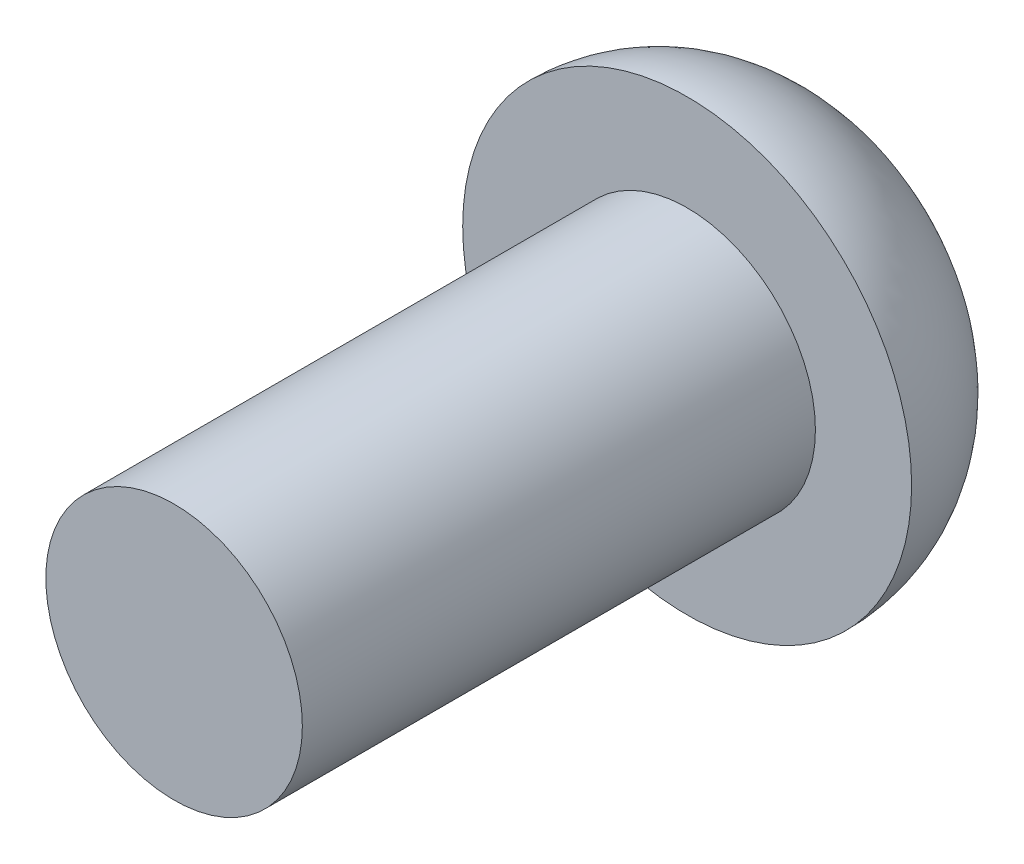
ISO-10303-21;
HEADER;
FILE_DESCRIPTION(('STEP AP214'),'2;1');
FILE_NAME('part.step','',(''),(''),'','','');
FILE_SCHEMA(('AUTOMOTIVE_DESIGN { 1 0 10303 214 1 1 1 1 }'));
ENDSEC;
DATA;
#1=APPLICATION_CONTEXT('core data for automotive mechanical design processes');
#2=APPLICATION_PROTOCOL_DEFINITION('international standard','automotive_design',2000,#1);
#3=PRODUCT_CONTEXT('',#1,'mechanical');
#4=PRODUCT('Part','Part','',(#3));
#5=PRODUCT_RELATED_PRODUCT_CATEGORY('part','',(#4));
#6=PRODUCT_DEFINITION_FORMATION('','',#4);
#7=PRODUCT_DEFINITION_CONTEXT('part definition',#1,'design');
#8=PRODUCT_DEFINITION('design','',#6,#7);
#9=PRODUCT_DEFINITION_SHAPE('','',#8);
#10=(LENGTH_UNIT() NAMED_UNIT(*) SI_UNIT(.MILLI.,.METRE.));
#11=(NAMED_UNIT(*) PLANE_ANGLE_UNIT() SI_UNIT($,.RADIAN.));
#12=(NAMED_UNIT(*) SI_UNIT($,.STERADIAN.) SOLID_ANGLE_UNIT());
#13=UNCERTAINTY_MEASURE_WITH_UNIT(LENGTH_MEASURE(1.E-05),#10,'distance_accuracy_value','');
#14=(GEOMETRIC_REPRESENTATION_CONTEXT(3) GLOBAL_UNCERTAINTY_ASSIGNED_CONTEXT((#13)) GLOBAL_UNIT_ASSIGNED_CONTEXT((#10,
#11,#12)) REPRESENTATION_CONTEXT('',''));
#15=CARTESIAN_POINT('',(0.,0.,0.));
#16=DIRECTION('',(0.,0.,1.));
#17=DIRECTION('',(1.,0.,0.));
#18=AXIS2_PLACEMENT_3D('',#15,#16,#17);
#19=CARTESIAN_POINT('',(0.,0.,5.));
#20=DIRECTION('',(0.,0.,1.));
#21=DIRECTION('',(1.,0.,0.));
#22=AXIS2_PLACEMENT_3D('',#19,#20,#21);
#23=PLANE('',#22);
#24=CARTESIAN_POINT('',(0.,0.,5.));
#25=DIRECTION('',(0.,0.,1.));
#26=DIRECTION('',(1.,0.,0.));
#27=AXIS2_PLACEMENT_3D('',#24,#25,#26);
#28=CIRCLE('',#27,7.);
#29=CARTESIAN_POINT('',(7.,0.,5.));
#30=VERTEX_POINT('',#29);
#31=EDGE_CURVE('E35',#30,#30,#28,.T.);
#32=ORIENTED_EDGE('',*,*,#31,.T.);
#33=EDGE_LOOP('',(#32));
#34=FACE_BOUND('',#33,.T.);
#35=CARTESIAN_POINT('',(0.,0.,5.));
#36=DIRECTION('',(0.,0.,1.));
#37=DIRECTION('',(1.,0.,0.));
#38=AXIS2_PLACEMENT_3D('',#35,#36,#37);
#39=CIRCLE('',#38,4.);
#40=CARTESIAN_POINT('',(4.,0.,5.));
#41=VERTEX_POINT('',#40);
#42=EDGE_CURVE('E43',#41,#41,#39,.T.);
#43=ORIENTED_EDGE('',*,*,#42,.F.);
#44=EDGE_LOOP('',(#43));
#45=FACE_BOUND('',#44,.T.);
#46=ADVANCED_FACE('F28',(#34,#45),#23,.T.);
#47=CARTESIAN_POINT('',(0.,0.,0.));
#48=DIRECTION('',(0.,0.,1.));
#49=DIRECTION('',(1.,0.,0.));
#50=AXIS2_PLACEMENT_3D('',#47,#48,#49);
#51=PLANE('',#50);
#52=CARTESIAN_POINT('',(0.,0.,0.));
#53=DIRECTION('',(0.,0.,1.));
#54=DIRECTION('',(1.,0.,0.));
#55=AXIS2_PLACEMENT_3D('',#52,#53,#54);
#56=CIRCLE('',#55,2.);
#57=CARTESIAN_POINT('',(2.,0.,0.));
#58=VERTEX_POINT('',#57);
#59=EDGE_CURVE('E10',#58,#58,#56,.F.);
#60=ORIENTED_EDGE('',*,*,#59,.T.);
#61=EDGE_LOOP('',(#60));
#62=FACE_BOUND('',#61,.T.);
#63=ADVANCED_FACE('F52',(#62),#51,.F.);
#64=CARTESIAN_POINT('',(0.,0.,21.));
#65=DIRECTION('',(0.,0.,-1.));
#66=DIRECTION('',(-1.,0.,0.));
#67=AXIS2_PLACEMENT_3D('',#64,#65,#66);
#68=CYLINDRICAL_SURFACE('',#67,4.);
#69=CARTESIAN_POINT('',(0.,0.,21.));
#70=DIRECTION('',(0.,0.,1.));
#71=DIRECTION('',(1.,0.,0.));
#72=AXIS2_PLACEMENT_3D('',#69,#70,#71);
#73=CIRCLE('',#72,4.);
#74=CARTESIAN_POINT('',(4.,0.,21.));
#75=VERTEX_POINT('',#74);
#76=EDGE_CURVE('E39',#75,#75,#73,.T.);
#77=ORIENTED_EDGE('',*,*,#76,.F.);
#78=EDGE_LOOP('',(#77));
#79=FACE_BOUND('',#78,.T.);
#80=ORIENTED_EDGE('',*,*,#42,.T.);
#81=EDGE_LOOP('',(#80));
#82=FACE_BOUND('',#81,.T.);
#83=ADVANCED_FACE('F49',(#79,#82),#68,.T.);
#84=CARTESIAN_POINT('',(0.,0.,21.));
#85=DIRECTION('',(0.,0.,1.));
#86=DIRECTION('',(1.,0.,0.));
#87=AXIS2_PLACEMENT_3D('',#84,#85,#86);
#88=PLANE('',#87);
#89=ORIENTED_EDGE('',*,*,#76,.T.);
#90=EDGE_LOOP('',(#89));
#91=FACE_BOUND('',#90,.T.);
#92=ADVANCED_FACE('F60',(#91),#88,.T.);
#93=CARTESIAN_POINT('',(0.,0.,5.));
#94=DIRECTION('',(0.,0.,1.));
#95=DIRECTION('',(1.,0.,0.));
#96=AXIS2_PLACEMENT_3D('',#93,#94,#95);
#97=DEGENERATE_TOROIDAL_SURFACE('',#96,2.,5.,.T.);
#98=ORIENTED_EDGE('',*,*,#59,.F.);
#99=EDGE_LOOP('',(#98));
#100=FACE_BOUND('',#99,.T.);
#101=ORIENTED_EDGE('',*,*,#31,.F.);
#102=EDGE_LOOP('',(#101));
#103=FACE_BOUND('',#102,.T.);
#104=ADVANCED_FACE('F30',(#100,#103),#97,.T.);
#105=CLOSED_SHELL('',(#46,#63,#83,#92,#104));
#106=MANIFOLD_SOLID_BREP('B2',#105);
#107=ADVANCED_BREP_SHAPE_REPRESENTATION('',(#18,#106),#14);
#108=SHAPE_DEFINITION_REPRESENTATION(#9,#107);
ENDSEC;
END-ISO-10303-21;
